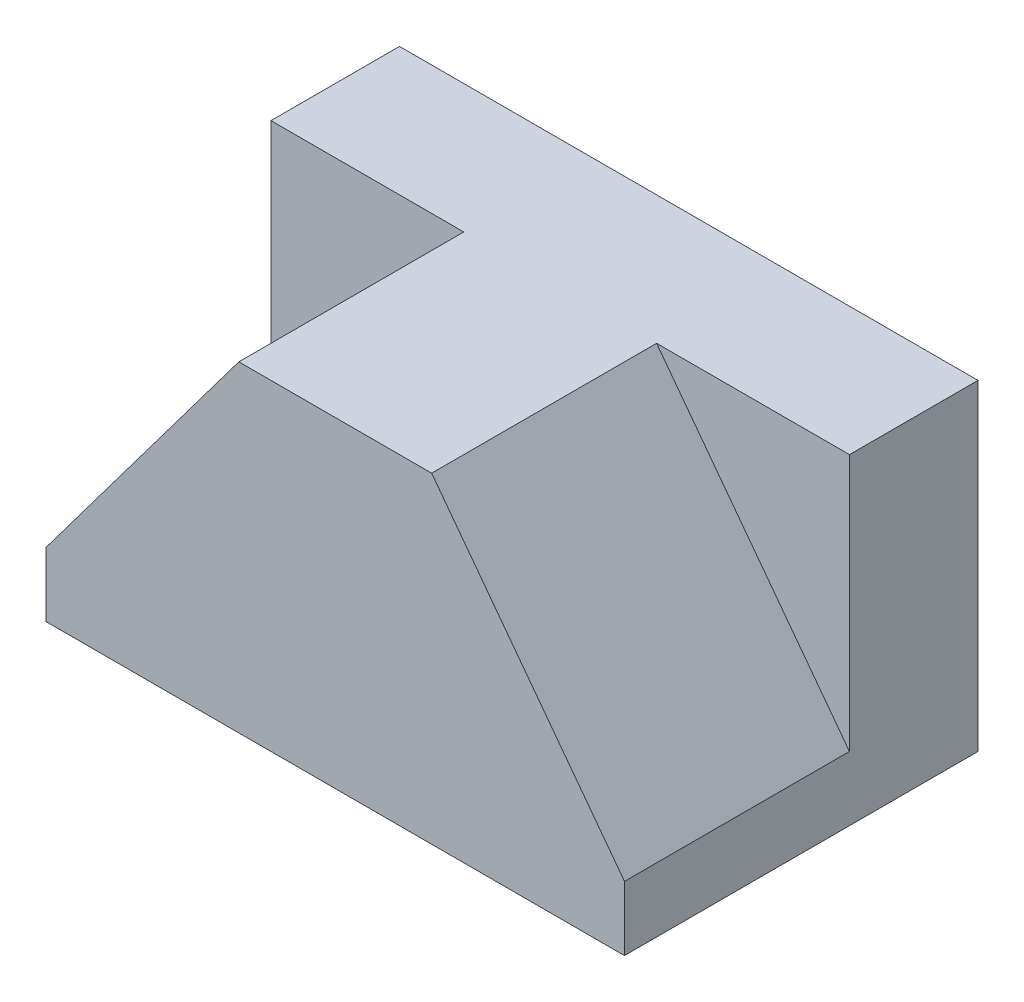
from build123d import *

# Parameters (mm, degrees)
SKETCH_1_W          = 90
SKETCH_1_H          = 55
EXTRUDE_1_DEPTH     = 50
CUT_EXTRUDE_1_DEPTH = 35


with BuildPart() as part:
    # Sketch 1 → Extrude 1 (new body)
    with BuildSketch(Plane(origin=(0, 0, 0), x_dir=(1, 0, 0), z_dir=(0, 1, 0))):
        with Locations((45, 27.5)):
            Rectangle(SKETCH_1_W, SKETCH_1_H)
    extrude(amount=EXTRUDE_1_DEPTH)

    # Sketch 2 → Cut-Extrude 1 (cut)
    with BuildSketch(Plane.XY):
        Polygon((0, 50), (30, 50), (0, 10), align=None)
        Polygon((90, 10), (90, 50), (60, 50), align=None)
    extrude(amount=-CUT_EXTRUDE_1_DEPTH, mode=Mode.SUBTRACT)


solid = part.part
